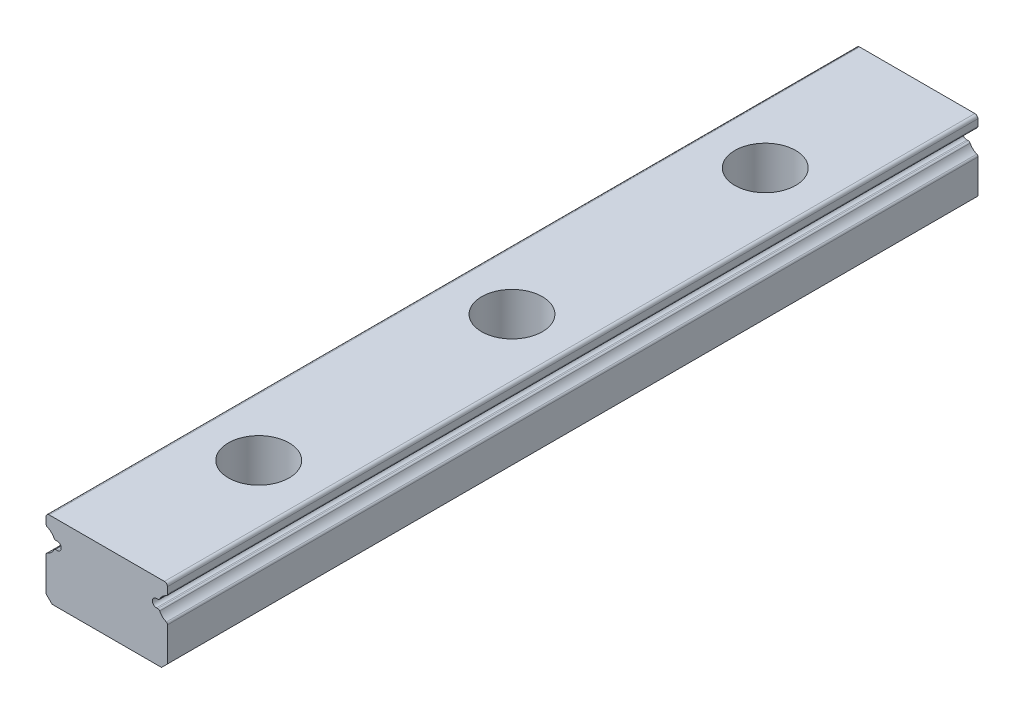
ISO-10303-21;
HEADER;
FILE_DESCRIPTION(('STEP AP214'),'2;1');
FILE_NAME('part.step','',(''),(''),'','','');
FILE_SCHEMA(('AUTOMOTIVE_DESIGN { 1 0 10303 214 1 1 1 1 }'));
ENDSEC;
DATA;
#1=APPLICATION_CONTEXT('core data for automotive mechanical design processes');
#2=APPLICATION_PROTOCOL_DEFINITION('international standard','automotive_design',2000,#1);
#3=PRODUCT_CONTEXT('',#1,'mechanical');
#4=PRODUCT('Part','Part','',(#3));
#5=PRODUCT_RELATED_PRODUCT_CATEGORY('part','',(#4));
#6=PRODUCT_DEFINITION_FORMATION('','',#4);
#7=PRODUCT_DEFINITION_CONTEXT('part definition',#1,'design');
#8=PRODUCT_DEFINITION('design','',#6,#7);
#9=PRODUCT_DEFINITION_SHAPE('','',#8);
#10=(LENGTH_UNIT() NAMED_UNIT(*) SI_UNIT(.MILLI.,.METRE.));
#11=(NAMED_UNIT(*) PLANE_ANGLE_UNIT() SI_UNIT($,.RADIAN.));
#12=(NAMED_UNIT(*) SI_UNIT($,.STERADIAN.) SOLID_ANGLE_UNIT());
#13=UNCERTAINTY_MEASURE_WITH_UNIT(LENGTH_MEASURE(1.E-05),#10,'distance_accuracy_value','');
#14=(GEOMETRIC_REPRESENTATION_CONTEXT(3) GLOBAL_UNCERTAINTY_ASSIGNED_CONTEXT((#13)) GLOBAL_UNIT_ASSIGNED_CONTEXT((#10,
#11,#12)) REPRESENTATION_CONTEXT('',''));
#15=CARTESIAN_POINT('',(0.,0.,0.));
#16=DIRECTION('',(0.,0.,1.));
#17=DIRECTION('',(1.,0.,0.));
#18=AXIS2_PLACEMENT_3D('',#15,#16,#17);
#19=CARTESIAN_POINT('',(-5.039393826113,-7.35,-80.));
#20=DIRECTION('',(0.,-1.,0.));
#21=DIRECTION('',(0.,0.,-1.));
#22=AXIS2_PLACEMENT_3D('',#19,#20,#21);
#23=PLANE('',#22);
#24=DIRECTION('',(1.,0.,0.));
#25=VECTOR('',#24,1.);
#26=CARTESIAN_POINT('',(-5.039393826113,-7.35,-80.));
#27=LINE('',#26,#25);
#28=CARTESIAN_POINT('',(-5.03939405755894,-7.35,-80.));
#29=VERTEX_POINT('',#28);
#30=CARTESIAN_POINT('',(-4.90000008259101,-7.35,-80.));
#31=VERTEX_POINT('',#30);
#32=EDGE_CURVE('E419',#29,#31,#27,.T.);
#33=ORIENTED_EDGE('',*,*,#32,.T.);
#34=DIRECTION('',(0.,0.,-1.));
#35=VECTOR('',#34,1.);
#36=CARTESIAN_POINT('',(-4.90000008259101,-7.35,-80.));
#37=LINE('',#36,#35);
#38=CARTESIAN_POINT('',(-4.90000008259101,-7.35,0.));
#39=VERTEX_POINT('',#38);
#40=EDGE_CURVE('E239',#31,#39,#37,.F.);
#41=ORIENTED_EDGE('',*,*,#40,.T.);
#42=DIRECTION('',(1.,0.,0.));
#43=VECTOR('',#42,1.);
#44=CARTESIAN_POINT('',(-5.039393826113,-7.35,0.));
#45=LINE('',#44,#43);
#46=CARTESIAN_POINT('',(-5.03939405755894,-7.35,0.));
#47=VERTEX_POINT('',#46);
#48=EDGE_CURVE('E423',#39,#47,#45,.F.);
#49=ORIENTED_EDGE('',*,*,#48,.T.);
#50=DIRECTION('',(0.,0.,-1.));
#51=VECTOR('',#50,1.);
#52=CARTESIAN_POINT('',(-5.039393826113,-7.35,-80.));
#53=LINE('',#52,#51);
#54=EDGE_CURVE('E242',#29,#47,#53,.F.);
#55=ORIENTED_EDGE('',*,*,#54,.F.);
#56=EDGE_LOOP('',(#33,#41,#49,#55));
#57=FACE_BOUND('',#56,.T.);
#58=ADVANCED_FACE('F16',(#57),#23,.T.);
#59=CARTESIAN_POINT('',(4.90000008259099,-7.35,-80.));
#60=DIRECTION('',(0.,-1.,0.));
#61=DIRECTION('',(0.,0.,-1.));
#62=AXIS2_PLACEMENT_3D('',#59,#60,#61);
#63=PLANE('',#62);
#64=DIRECTION('',(1.,0.,0.));
#65=VECTOR('',#64,1.);
#66=CARTESIAN_POINT('',(4.90000008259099,-7.35,-80.));
#67=LINE('',#66,#65);
#68=CARTESIAN_POINT('',(4.90000008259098,-7.35,-80.));
#69=VERTEX_POINT('',#68);
#70=CARTESIAN_POINT('',(5.04039419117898,-7.35,-80.));
#71=VERTEX_POINT('',#70);
#72=EDGE_CURVE('E209',#69,#71,#67,.T.);
#73=ORIENTED_EDGE('',*,*,#72,.T.);
#74=DIRECTION('',(0.,0.,-1.));
#75=VECTOR('',#74,1.);
#76=CARTESIAN_POINT('',(5.040394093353,-7.35,-80.));
#77=LINE('',#76,#75);
#78=CARTESIAN_POINT('',(5.04039419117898,-7.35,0.));
#79=VERTEX_POINT('',#78);
#80=EDGE_CURVE('E208',#79,#71,#77,.T.);
#81=ORIENTED_EDGE('',*,*,#80,.F.);
#82=DIRECTION('',(1.,0.,0.));
#83=VECTOR('',#82,1.);
#84=CARTESIAN_POINT('',(4.90000008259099,-7.35,0.));
#85=LINE('',#84,#83);
#86=CARTESIAN_POINT('',(4.90000008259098,-7.35,0.));
#87=VERTEX_POINT('',#86);
#88=EDGE_CURVE('E204',#79,#87,#85,.F.);
#89=ORIENTED_EDGE('',*,*,#88,.T.);
#90=DIRECTION('',(0.,0.,-1.));
#91=VECTOR('',#90,1.);
#92=CARTESIAN_POINT('',(4.90000008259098,-7.35,-80.));
#93=LINE('',#92,#91);
#94=EDGE_CURVE('E236',#87,#69,#93,.T.);
#95=ORIENTED_EDGE('',*,*,#94,.T.);
#96=EDGE_LOOP('',(#73,#81,#89,#95));
#97=FACE_BOUND('',#96,.T.);
#98=ADVANCED_FACE('F448',(#97),#63,.T.);
#99=CARTESIAN_POINT('',(5.04039428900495,-7.15000000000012,-80.));
#100=DIRECTION('',(0.,0.,-1.));
#101=DIRECTION('',(-1.,0.,0.));
#102=AXIS2_PLACEMENT_3D('',#99,#100,#101);
#103=CYLINDRICAL_SURFACE('',#102,0.2);
#104=CARTESIAN_POINT('',(5.04039428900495,-7.15000000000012,-80.));
#105=DIRECTION('',(0.,0.,-1.));
#106=DIRECTION('',(-1.,0.,0.));
#107=AXIS2_PLACEMENT_3D('',#104,#105,#106);
#108=CIRCLE('',#107,0.2);
#109=CARTESIAN_POINT('',(5.21899999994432,-7.24000000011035,-80.));
#110=VERTEX_POINT('',#109);
#111=EDGE_CURVE('E215',#71,#110,#108,.F.);
#112=ORIENTED_EDGE('',*,*,#111,.T.);
#113=DIRECTION('',(0.,0.,-1.));
#114=VECTOR('',#113,1.);
#115=CARTESIAN_POINT('',(5.21899999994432,-7.24000000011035,-80.));
#116=LINE('',#115,#114);
#117=CARTESIAN_POINT('',(5.21899999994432,-7.24000000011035,0.));
#118=VERTEX_POINT('',#117);
#119=EDGE_CURVE('E212',#110,#118,#116,.F.);
#120=ORIENTED_EDGE('',*,*,#119,.T.);
#121=CARTESIAN_POINT('',(5.04039428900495,-7.15000000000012,0.));
#122=DIRECTION('',(0.,0.,-1.));
#123=DIRECTION('',(-1.,0.,0.));
#124=AXIS2_PLACEMENT_3D('',#121,#122,#123);
#125=CIRCLE('',#124,0.2);
#126=EDGE_CURVE('E19',#118,#79,#125,.T.);
#127=ORIENTED_EDGE('',*,*,#126,.T.);
#128=ORIENTED_EDGE('',*,*,#80,.T.);
#129=EDGE_LOOP('',(#112,#120,#127,#128));
#130=FACE_BOUND('',#129,.T.);
#131=ADVANCED_FACE('F213',(#130),#103,.T.);
#132=CARTESIAN_POINT('',(-5.03939428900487,-7.15000000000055,-80.));
#133=DIRECTION('',(0.,0.,-1.));
#134=DIRECTION('',(-1.,0.,0.));
#135=AXIS2_PLACEMENT_3D('',#132,#133,#134);
#136=CYLINDRICAL_SURFACE('',#135,0.200000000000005);
#137=CARTESIAN_POINT('',(-5.03939428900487,-7.15000000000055,-80.));
#138=DIRECTION('',(0.,0.,-1.));
#139=DIRECTION('',(-1.,0.,0.));
#140=AXIS2_PLACEMENT_3D('',#137,#138,#139);
#141=CIRCLE('',#140,0.200000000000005);
#142=CARTESIAN_POINT('',(-5.21799999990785,-7.24000000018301,-80.));
#143=VERTEX_POINT('',#142);
#144=EDGE_CURVE('E243',#143,#29,#141,.F.);
#145=ORIENTED_EDGE('',*,*,#144,.T.);
#146=ORIENTED_EDGE('',*,*,#54,.T.);
#147=CARTESIAN_POINT('',(-5.03939428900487,-7.15000000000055,0.));
#148=DIRECTION('',(0.,0.,-1.));
#149=DIRECTION('',(-1.,0.,0.));
#150=AXIS2_PLACEMENT_3D('',#147,#148,#149);
#151=CIRCLE('',#150,0.200000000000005);
#152=CARTESIAN_POINT('',(-5.21799999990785,-7.24000000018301,0.));
#153=VERTEX_POINT('',#152);
#154=EDGE_CURVE('E246',#47,#153,#151,.T.);
#155=ORIENTED_EDGE('',*,*,#154,.T.);
#156=DIRECTION('',(0.,0.,-1.));
#157=VECTOR('',#156,1.);
#158=CARTESIAN_POINT('',(-5.21799999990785,-7.24000000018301,-80.));
#159=LINE('',#158,#157);
#160=EDGE_CURVE('E223',#153,#143,#159,.T.);
#161=ORIENTED_EDGE('',*,*,#160,.T.);
#162=EDGE_LOOP('',(#145,#146,#155,#161));
#163=FACE_BOUND('',#162,.T.);
#164=ADVANCED_FACE('F437',(#163),#136,.T.);
#165=CARTESIAN_POINT('',(-4.900000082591,-7.75,-80.));
#166=DIRECTION('',(0.,0.,-1.));
#167=DIRECTION('',(-1.,0.,0.));
#168=AXIS2_PLACEMENT_3D('',#165,#166,#167);
#169=CYLINDRICAL_SURFACE('',#168,0.399999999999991);
#170=ORIENTED_EDGE('',*,*,#40,.F.);
#171=CARTESIAN_POINT('',(-4.900000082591,-7.75,-80.));
#172=DIRECTION('',(0.,0.,-1.));
#173=DIRECTION('',(-1.,0.,0.));
#174=AXIS2_PLACEMENT_3D('',#171,#172,#173);
#175=CIRCLE('',#174,0.399999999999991);
#176=CARTESIAN_POINT('',(-4.900000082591,-8.15,-80.));
#177=VERTEX_POINT('',#176);
#178=EDGE_CURVE('E240',#177,#31,#175,.F.);
#179=ORIENTED_EDGE('',*,*,#178,.F.);
#180=DIRECTION('',(0.,0.,1.));
#181=VECTOR('',#180,1.);
#182=CARTESIAN_POINT('',(-4.900000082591,-8.15,-80.));
#183=LINE('',#182,#181);
#184=CARTESIAN_POINT('',(-4.900000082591,-8.15,0.));
#185=VERTEX_POINT('',#184);
#186=EDGE_CURVE('E357',#185,#177,#183,.F.);
#187=ORIENTED_EDGE('',*,*,#186,.F.);
#188=CARTESIAN_POINT('',(-4.900000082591,-7.75,0.));
#189=DIRECTION('',(0.,0.,-1.));
#190=DIRECTION('',(-1.,0.,0.));
#191=AXIS2_PLACEMENT_3D('',#188,#189,#190);
#192=CIRCLE('',#191,0.399999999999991);
#193=EDGE_CURVE('E237',#39,#185,#192,.T.);
#194=ORIENTED_EDGE('',*,*,#193,.F.);
#195=EDGE_LOOP('',(#170,#179,#187,#194));
#196=FACE_BOUND('',#195,.T.);
#197=ADVANCED_FACE('F432',(#196),#169,.F.);
#198=CARTESIAN_POINT('',(4.90000008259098,-7.75,-80.));
#199=DIRECTION('',(0.,0.,-1.));
#200=DIRECTION('',(-1.,0.,0.));
#201=AXIS2_PLACEMENT_3D('',#198,#199,#200);
#202=CYLINDRICAL_SURFACE('',#201,0.399999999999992);
#203=DIRECTION('',(0.,0.,1.));
#204=VECTOR('',#203,1.);
#205=CARTESIAN_POINT('',(4.90000008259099,-8.15,-80.));
#206=LINE('',#205,#204);
#207=CARTESIAN_POINT('',(4.90000008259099,-8.15,-80.));
#208=VERTEX_POINT('',#207);
#209=CARTESIAN_POINT('',(4.90000008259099,-8.15,0.));
#210=VERTEX_POINT('',#209);
#211=EDGE_CURVE('E350',#208,#210,#206,.T.);
#212=ORIENTED_EDGE('',*,*,#211,.F.);
#213=CARTESIAN_POINT('',(4.90000008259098,-7.75,-80.));
#214=DIRECTION('',(0.,0.,-1.));
#215=DIRECTION('',(-1.,0.,0.));
#216=AXIS2_PLACEMENT_3D('',#213,#214,#215);
#217=CIRCLE('',#216,0.399999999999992);
#218=EDGE_CURVE('E234',#69,#208,#217,.F.);
#219=ORIENTED_EDGE('',*,*,#218,.F.);
#220=ORIENTED_EDGE('',*,*,#94,.F.);
#221=CARTESIAN_POINT('',(4.90000008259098,-7.75,0.));
#222=DIRECTION('',(0.,0.,-1.));
#223=DIRECTION('',(-1.,0.,0.));
#224=AXIS2_PLACEMENT_3D('',#221,#222,#223);
#225=CIRCLE('',#224,0.399999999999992);
#226=EDGE_CURVE('E232',#210,#87,#225,.T.);
#227=ORIENTED_EDGE('',*,*,#226,.F.);
#228=EDGE_LOOP('',(#212,#219,#220,#227));
#229=FACE_BOUND('',#228,.T.);
#230=ADVANCED_FACE('F446',(#229),#202,.F.);
#231=CARTESIAN_POINT('',(6.36838540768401,-7.81680948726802,-80.));
#232=DIRECTION('',(0.,0.,-1.));
#233=DIRECTION('',(-1.,0.,0.));
#234=AXIS2_PLACEMENT_3D('',#231,#232,#233);
#235=CYLINDRICAL_SURFACE('',#234,1.286);
#236=ORIENTED_EDGE('',*,*,#119,.F.);
#237=CARTESIAN_POINT('',(6.36838540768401,-7.81680948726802,-80.));
#238=DIRECTION('',(0.,0.,-1.));
#239=DIRECTION('',(-1.,0.,0.));
#240=AXIS2_PLACEMENT_3D('',#237,#238,#239);
#241=CIRCLE('',#240,1.286);
#242=CARTESIAN_POINT('',(5.8660000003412,-6.63299999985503,-80.));
#243=VERTEX_POINT('',#242);
#244=EDGE_CURVE('E217',#243,#110,#241,.F.);
#245=ORIENTED_EDGE('',*,*,#244,.F.);
#246=DIRECTION('',(0.,0.,-1.));
#247=VECTOR('',#246,1.);
#248=CARTESIAN_POINT('',(5.8660000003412,-6.63299999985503,-80.));
#249=LINE('',#248,#247);
#250=CARTESIAN_POINT('',(5.8660000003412,-6.63299999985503,0.));
#251=VERTEX_POINT('',#250);
#252=EDGE_CURVE('E221',#251,#243,#249,.T.);
#253=ORIENTED_EDGE('',*,*,#252,.F.);
#254=CARTESIAN_POINT('',(6.36838540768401,-7.81680948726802,0.));
#255=DIRECTION('',(0.,0.,-1.));
#256=DIRECTION('',(-1.,0.,0.));
#257=AXIS2_PLACEMENT_3D('',#254,#255,#256);
#258=CIRCLE('',#257,1.286);
#259=EDGE_CURVE('E201',#118,#251,#258,.T.);
#260=ORIENTED_EDGE('',*,*,#259,.F.);
#261=EDGE_LOOP('',(#236,#245,#253,#260));
#262=FACE_BOUND('',#261,.T.);
#263=ADVANCED_FACE('F219',(#262),#235,.F.);
#264=CARTESIAN_POINT('',(-6.36738540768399,-7.81680948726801,-80.));
#265=DIRECTION('',(0.,0.,-1.));
#266=DIRECTION('',(-1.,0.,0.));
#267=AXIS2_PLACEMENT_3D('',#264,#265,#266);
#268=CYLINDRICAL_SURFACE('',#267,1.286);
#269=DIRECTION('',(0.,0.,-1.));
#270=VECTOR('',#269,1.);
#271=CARTESIAN_POINT('',(-5.86500000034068,-6.63299999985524,-80.));
#272=LINE('',#271,#270);
#273=CARTESIAN_POINT('',(-5.86500000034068,-6.63299999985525,-80.));
#274=VERTEX_POINT('',#273);
#275=CARTESIAN_POINT('',(-5.86500000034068,-6.63299999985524,0.));
#276=VERTEX_POINT('',#275);
#277=EDGE_CURVE('E340',#274,#276,#272,.F.);
#278=ORIENTED_EDGE('',*,*,#277,.F.);
#279=CARTESIAN_POINT('',(-6.36738540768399,-7.81680948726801,-80.));
#280=DIRECTION('',(0.,0.,-1.));
#281=DIRECTION('',(-1.,0.,0.));
#282=AXIS2_PLACEMENT_3D('',#279,#280,#281);
#283=CIRCLE('',#282,1.286);
#284=EDGE_CURVE('E226',#143,#274,#283,.F.);
#285=ORIENTED_EDGE('',*,*,#284,.F.);
#286=ORIENTED_EDGE('',*,*,#160,.F.);
#287=CARTESIAN_POINT('',(-6.36738540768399,-7.81680948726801,0.));
#288=DIRECTION('',(0.,0.,-1.));
#289=DIRECTION('',(-1.,0.,0.));
#290=AXIS2_PLACEMENT_3D('',#287,#288,#289);
#291=CIRCLE('',#290,1.286);
#292=EDGE_CURVE('E351',#276,#153,#291,.T.);
#293=ORIENTED_EDGE('',*,*,#292,.F.);
#294=EDGE_LOOP('',(#278,#285,#286,#293));
#295=FACE_BOUND('',#294,.T.);
#296=ADVANCED_FACE('F366',(#295),#268,.F.);
#297=CARTESIAN_POINT('',(-4.90000008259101,-8.15,-80.));
#298=DIRECTION('',(0.,1.,0.));
#299=DIRECTION('',(0.,0.,1.));
#300=AXIS2_PLACEMENT_3D('',#297,#298,#299);
#301=PLANE('',#300);
#302=DIRECTION('',(1.,0.,0.));
#303=VECTOR('',#302,1.);
#304=CARTESIAN_POINT('',(-4.90000008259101,-8.15,-80.));
#305=LINE('',#304,#303);
#306=CARTESIAN_POINT('',(-5.03939405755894,-8.15,-80.));
#307=VERTEX_POINT('',#306);
#308=EDGE_CURVE('E407',#177,#307,#305,.F.);
#309=ORIENTED_EDGE('',*,*,#308,.T.);
#310=DIRECTION('',(0.,0.,-1.));
#311=VECTOR('',#310,1.);
#312=CARTESIAN_POINT('',(-5.039393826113,-8.15,-80.));
#313=LINE('',#312,#311);
#314=CARTESIAN_POINT('',(-5.03939405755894,-8.15,0.));
#315=VERTEX_POINT('',#314);
#316=EDGE_CURVE('E336',#315,#307,#313,.T.);
#317=ORIENTED_EDGE('',*,*,#316,.F.);
#318=DIRECTION('',(1.,0.,0.));
#319=VECTOR('',#318,1.);
#320=CARTESIAN_POINT('',(-4.90000008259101,-8.15,0.));
#321=LINE('',#320,#319);
#322=EDGE_CURVE('E353',#315,#185,#321,.T.);
#323=ORIENTED_EDGE('',*,*,#322,.T.);
#324=ORIENTED_EDGE('',*,*,#186,.T.);
#325=EDGE_LOOP('',(#309,#317,#323,#324));
#326=FACE_BOUND('',#325,.T.);
#327=ADVANCED_FACE('F566',(#326),#301,.T.);
#328=CARTESIAN_POINT('',(5.040394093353,-8.15,-80.));
#329=DIRECTION('',(0.,1.,0.));
#330=DIRECTION('',(0.,0.,1.));
#331=AXIS2_PLACEMENT_3D('',#328,#329,#330);
#332=PLANE('',#331);
#333=DIRECTION('',(1.,0.,0.));
#334=VECTOR('',#333,1.);
#335=CARTESIAN_POINT('',(5.040394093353,-8.15,-80.));
#336=LINE('',#335,#334);
#337=CARTESIAN_POINT('',(5.04039419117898,-8.15,-80.));
#338=VERTEX_POINT('',#337);
#339=EDGE_CURVE('E401',#338,#208,#336,.F.);
#340=ORIENTED_EDGE('',*,*,#339,.T.);
#341=ORIENTED_EDGE('',*,*,#211,.T.);
#342=DIRECTION('',(1.,0.,0.));
#343=VECTOR('',#342,1.);
#344=CARTESIAN_POINT('',(5.040394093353,-8.15,0.));
#345=LINE('',#344,#343);
#346=CARTESIAN_POINT('',(5.04039419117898,-8.15,0.));
#347=VERTEX_POINT('',#346);
#348=EDGE_CURVE('E404',#210,#347,#345,.T.);
#349=ORIENTED_EDGE('',*,*,#348,.T.);
#350=DIRECTION('',(0.,0.,-1.));
#351=VECTOR('',#350,1.);
#352=CARTESIAN_POINT('',(5.040394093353,-8.15,-80.));
#353=LINE('',#352,#351);
#354=EDGE_CURVE('E330',#338,#347,#353,.F.);
#355=ORIENTED_EDGE('',*,*,#354,.F.);
#356=EDGE_LOOP('',(#340,#341,#349,#355));
#357=FACE_BOUND('',#356,.T.);
#358=ADVANCED_FACE('F562',(#357),#332,.T.);
#359=CARTESIAN_POINT('',(5.788,-6.44883702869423,-80.));
#360=DIRECTION('',(0.,0.,-1.));
#361=DIRECTION('',(-1.,0.,0.));
#362=AXIS2_PLACEMENT_3D('',#359,#360,#361);
#363=CYLINDRICAL_SURFACE('',#362,0.200000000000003);
#364=CARTESIAN_POINT('',(5.788,-6.44883702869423,-80.));
#365=DIRECTION('',(0.,0.,-1.));
#366=DIRECTION('',(-1.,0.,0.));
#367=AXIS2_PLACEMENT_3D('',#364,#365,#366);
#368=CIRCLE('',#367,0.200000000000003);
#369=CARTESIAN_POINT('',(5.988,-6.4488370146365,-80.));
#370=VERTEX_POINT('',#369);
#371=EDGE_CURVE('E347',#243,#370,#368,.F.);
#372=ORIENTED_EDGE('',*,*,#371,.T.);
#373=DIRECTION('',(0.,0.,-1.));
#374=VECTOR('',#373,1.);
#375=CARTESIAN_POINT('',(5.988,-6.44883700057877,-80.));
#376=LINE('',#375,#374);
#377=CARTESIAN_POINT('',(5.988,-6.4488370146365,0.));
#378=VERTEX_POINT('',#377);
#379=EDGE_CURVE('E389',#378,#370,#376,.T.);
#380=ORIENTED_EDGE('',*,*,#379,.F.);
#381=CARTESIAN_POINT('',(5.788,-6.44883702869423,0.));
#382=DIRECTION('',(0.,0.,-1.));
#383=DIRECTION('',(-1.,0.,0.));
#384=AXIS2_PLACEMENT_3D('',#381,#382,#383);
#385=CIRCLE('',#384,0.200000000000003);
#386=EDGE_CURVE('E349',#378,#251,#385,.T.);
#387=ORIENTED_EDGE('',*,*,#386,.T.);
#388=ORIENTED_EDGE('',*,*,#252,.T.);
#389=EDGE_LOOP('',(#372,#380,#387,#388));
#390=FACE_BOUND('',#389,.T.);
#391=ADVANCED_FACE('F559',(#390),#363,.T.);
#392=CARTESIAN_POINT('',(-5.787,-6.44883702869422,-80.));
#393=DIRECTION('',(0.,0.,-1.));
#394=DIRECTION('',(-1.,0.,0.));
#395=AXIS2_PLACEMENT_3D('',#392,#393,#394);
#396=CYLINDRICAL_SURFACE('',#395,0.2);
#397=CARTESIAN_POINT('',(-5.787,-6.44883702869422,-80.));
#398=DIRECTION('',(0.,0.,-1.));
#399=DIRECTION('',(-1.,0.,0.));
#400=AXIS2_PLACEMENT_3D('',#397,#398,#399);
#401=CIRCLE('',#400,0.2);
#402=CARTESIAN_POINT('',(-5.987,-6.44883701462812,-80.));
#403=VERTEX_POINT('',#402);
#404=EDGE_CURVE('E341',#403,#274,#401,.F.);
#405=ORIENTED_EDGE('',*,*,#404,.T.);
#406=ORIENTED_EDGE('',*,*,#277,.T.);
#407=CARTESIAN_POINT('',(-5.787,-6.44883702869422,0.));
#408=DIRECTION('',(0.,0.,-1.));
#409=DIRECTION('',(-1.,0.,0.));
#410=AXIS2_PLACEMENT_3D('',#407,#408,#409);
#411=CIRCLE('',#410,0.2);
#412=CARTESIAN_POINT('',(-5.987,-6.44883701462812,0.));
#413=VERTEX_POINT('',#412);
#414=EDGE_CURVE('E344',#276,#413,#411,.T.);
#415=ORIENTED_EDGE('',*,*,#414,.T.);
#416=DIRECTION('',(0.,0.,1.));
#417=VECTOR('',#416,1.);
#418=CARTESIAN_POINT('',(-5.987,-6.44883700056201,-80.));
#419=LINE('',#418,#417);
#420=EDGE_CURVE('E326',#403,#413,#419,.T.);
#421=ORIENTED_EDGE('',*,*,#420,.F.);
#422=EDGE_LOOP('',(#405,#406,#415,#421));
#423=FACE_BOUND('',#422,.T.);
#424=ADVANCED_FACE('F369',(#423),#396,.T.);
#425=CARTESIAN_POINT('',(-5.03939428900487,-8.34999999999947,-80.));
#426=DIRECTION('',(0.,0.,-1.));
#427=DIRECTION('',(-1.,0.,0.));
#428=AXIS2_PLACEMENT_3D('',#425,#426,#427);
#429=CYLINDRICAL_SURFACE('',#428,0.200000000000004);
#430=CARTESIAN_POINT('',(-5.03939428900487,-8.34999999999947,-80.));
#431=DIRECTION('',(0.,0.,-1.));
#432=DIRECTION('',(-1.,0.,0.));
#433=AXIS2_PLACEMENT_3D('',#430,#431,#432);
#434=CIRCLE('',#433,0.200000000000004);
#435=CARTESIAN_POINT('',(-5.21800000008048,-8.26000000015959,-80.));
#436=VERTEX_POINT('',#435);
#437=EDGE_CURVE('E333',#307,#436,#434,.F.);
#438=ORIENTED_EDGE('',*,*,#437,.T.);
#439=DIRECTION('',(0.,0.,-1.));
#440=VECTOR('',#439,1.);
#441=CARTESIAN_POINT('',(-5.21800000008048,-8.26000000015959,-80.));
#442=LINE('',#441,#440);
#443=CARTESIAN_POINT('',(-5.21800000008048,-8.26000000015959,0.));
#444=VERTEX_POINT('',#443);
#445=EDGE_CURVE('E323',#436,#444,#442,.F.);
#446=ORIENTED_EDGE('',*,*,#445,.T.);
#447=CARTESIAN_POINT('',(-5.03939428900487,-8.34999999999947,0.));
#448=DIRECTION('',(0.,0.,-1.));
#449=DIRECTION('',(-1.,0.,0.));
#450=AXIS2_PLACEMENT_3D('',#447,#448,#449);
#451=CIRCLE('',#450,0.200000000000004);
#452=EDGE_CURVE('E337',#444,#315,#451,.T.);
#453=ORIENTED_EDGE('',*,*,#452,.T.);
#454=ORIENTED_EDGE('',*,*,#316,.T.);
#455=EDGE_LOOP('',(#438,#446,#453,#454));
#456=FACE_BOUND('',#455,.T.);
#457=ADVANCED_FACE('F552',(#456),#429,.T.);
#458=CARTESIAN_POINT('',(5.04039428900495,-8.34999999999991,-80.));
#459=DIRECTION('',(0.,0.,-1.));
#460=DIRECTION('',(-1.,0.,0.));
#461=AXIS2_PLACEMENT_3D('',#458,#459,#460);
#462=CYLINDRICAL_SURFACE('',#461,0.200000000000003);
#463=CARTESIAN_POINT('',(5.04039428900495,-8.34999999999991,-80.));
#464=DIRECTION('',(0.,0.,-1.));
#465=DIRECTION('',(-1.,0.,0.));
#466=AXIS2_PLACEMENT_3D('',#463,#464,#465);
#467=CIRCLE('',#466,0.200000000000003);
#468=CARTESIAN_POINT('',(5.21900000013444,-8.26000000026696,-80.));
#469=VERTEX_POINT('',#468);
#470=EDGE_CURVE('E327',#469,#338,#467,.F.);
#471=ORIENTED_EDGE('',*,*,#470,.T.);
#472=ORIENTED_EDGE('',*,*,#354,.T.);
#473=CARTESIAN_POINT('',(5.04039428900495,-8.34999999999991,0.));
#474=DIRECTION('',(0.,0.,-1.));
#475=DIRECTION('',(-1.,0.,0.));
#476=AXIS2_PLACEMENT_3D('',#473,#474,#475);
#477=CIRCLE('',#476,0.200000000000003);
#478=CARTESIAN_POINT('',(5.21900000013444,-8.26000000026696,0.));
#479=VERTEX_POINT('',#478);
#480=EDGE_CURVE('E331',#347,#479,#477,.T.);
#481=ORIENTED_EDGE('',*,*,#480,.T.);
#482=DIRECTION('',(0.,0.,-1.));
#483=VECTOR('',#482,1.);
#484=CARTESIAN_POINT('',(5.21900000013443,-8.26000000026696,-80.));
#485=LINE('',#484,#483);
#486=EDGE_CURVE('E320',#479,#469,#485,.T.);
#487=ORIENTED_EDGE('',*,*,#486,.T.);
#488=EDGE_LOOP('',(#471,#472,#481,#487));
#489=FACE_BOUND('',#488,.T.);
#490=ADVANCED_FACE('F548',(#489),#462,.T.);
#491=CARTESIAN_POINT('',(5.988,-6.44883700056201,-80.));
#492=DIRECTION('',(1.,0.,0.));
#493=DIRECTION('',(0.,0.,-1.));
#494=AXIS2_PLACEMENT_3D('',#491,#492,#493);
#495=PLANE('',#494);
#496=DIRECTION('',(0.,1.,0.));
#497=VECTOR('',#496,1.);
#498=CARTESIAN_POINT('',(5.988,-6.44883700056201,-80.));
#499=LINE('',#498,#497);
#500=CARTESIAN_POINT('',(5.988,-5.8,-80.));
#501=VERTEX_POINT('',#500);
#502=EDGE_CURVE('E381',#370,#501,#499,.T.);
#503=ORIENTED_EDGE('',*,*,#502,.T.);
#504=DIRECTION('',(0.,0.,-1.));
#505=VECTOR('',#504,1.);
#506=CARTESIAN_POINT('',(5.988,-5.8,-80.));
#507=LINE('',#506,#505);
#508=CARTESIAN_POINT('',(5.988,-5.8,0.));
#509=VERTEX_POINT('',#508);
#510=EDGE_CURVE('E311',#509,#501,#507,.T.);
#511=ORIENTED_EDGE('',*,*,#510,.F.);
#512=DIRECTION('',(0.,1.,0.));
#513=VECTOR('',#512,1.);
#514=CARTESIAN_POINT('',(5.988,-6.44883700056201,0.));
#515=LINE('',#514,#513);
#516=EDGE_CURVE('E390',#509,#378,#515,.F.);
#517=ORIENTED_EDGE('',*,*,#516,.T.);
#518=ORIENTED_EDGE('',*,*,#379,.T.);
#519=EDGE_LOOP('',(#503,#511,#517,#518));
#520=FACE_BOUND('',#519,.T.);
#521=ADVANCED_FACE('F545',(#520),#495,.T.);
#522=CARTESIAN_POINT('',(-5.987,-5.8,-80.));
#523=DIRECTION('',(-1.,0.,0.));
#524=DIRECTION('',(0.,0.,1.));
#525=AXIS2_PLACEMENT_3D('',#522,#523,#524);
#526=PLANE('',#525);
#527=DIRECTION('',(0.,1.,0.));
#528=VECTOR('',#527,1.);
#529=CARTESIAN_POINT('',(-5.987,-5.8,-80.));
#530=LINE('',#529,#528);
#531=CARTESIAN_POINT('',(-5.987,-5.8,-80.));
#532=VERTEX_POINT('',#531);
#533=EDGE_CURVE('E374',#532,#403,#530,.F.);
#534=ORIENTED_EDGE('',*,*,#533,.T.);
#535=ORIENTED_EDGE('',*,*,#420,.T.);
#536=DIRECTION('',(0.,1.,0.));
#537=VECTOR('',#536,1.);
#538=CARTESIAN_POINT('',(-5.987,-5.8,0.));
#539=LINE('',#538,#537);
#540=CARTESIAN_POINT('',(-5.987,-5.8,0.));
#541=VERTEX_POINT('',#540);
#542=EDGE_CURVE('E379',#413,#541,#539,.T.);
#543=ORIENTED_EDGE('',*,*,#542,.T.);
#544=DIRECTION('',(0.,0.,-1.));
#545=VECTOR('',#544,1.);
#546=CARTESIAN_POINT('',(-5.987,-5.8,-80.));
#547=LINE('',#546,#545);
#548=EDGE_CURVE('E303',#532,#541,#547,.F.);
#549=ORIENTED_EDGE('',*,*,#548,.F.);
#550=EDGE_LOOP('',(#534,#535,#543,#549));
#551=FACE_BOUND('',#550,.T.);
#552=ADVANCED_FACE('F377',(#551),#526,.T.);
#553=CARTESIAN_POINT('',(-6.36699997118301,-7.68242310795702,-80.));
#554=DIRECTION('',(0.,0.,-1.));
#555=DIRECTION('',(-1.,0.,0.));
#556=AXIS2_PLACEMENT_3D('',#553,#554,#555);
#557=CYLINDRICAL_SURFACE('',#556,1.286);
#558=ORIENTED_EDGE('',*,*,#445,.F.);
#559=CARTESIAN_POINT('',(-6.36699997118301,-7.68242310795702,-80.));
#560=DIRECTION('',(0.,0.,-1.));
#561=DIRECTION('',(-1.,0.,0.));
#562=AXIS2_PLACEMENT_3D('',#559,#560,#561);
#563=CIRCLE('',#562,1.286);
#564=CARTESIAN_POINT('',(-5.87600000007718,-8.87100000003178,-80.));
#565=VERTEX_POINT('',#564);
#566=EDGE_CURVE('E324',#565,#436,#563,.F.);
#567=ORIENTED_EDGE('',*,*,#566,.F.);
#568=DIRECTION('',(0.,0.,-1.));
#569=VECTOR('',#568,1.);
#570=CARTESIAN_POINT('',(-5.87600000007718,-8.87100000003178,-80.));
#571=LINE('',#570,#569);
#572=CARTESIAN_POINT('',(-5.87600000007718,-8.87100000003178,0.));
#573=VERTEX_POINT('',#572);
#574=EDGE_CURVE('E299',#573,#565,#571,.T.);
#575=ORIENTED_EDGE('',*,*,#574,.F.);
#576=CARTESIAN_POINT('',(-6.36699997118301,-7.68242310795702,0.));
#577=DIRECTION('',(0.,0.,-1.));
#578=DIRECTION('',(-1.,0.,0.));
#579=AXIS2_PLACEMENT_3D('',#576,#577,#578);
#580=CIRCLE('',#579,1.286);
#581=EDGE_CURVE('E321',#444,#573,#580,.T.);
#582=ORIENTED_EDGE('',*,*,#581,.F.);
#583=EDGE_LOOP('',(#558,#567,#575,#582));
#584=FACE_BOUND('',#583,.T.);
#585=ADVANCED_FACE('F538',(#584),#557,.F.);
#586=CARTESIAN_POINT('',(6.36799997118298,-7.68242310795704,-80.));
#587=DIRECTION('',(0.,0.,-1.));
#588=DIRECTION('',(-1.,0.,0.));
#589=AXIS2_PLACEMENT_3D('',#586,#587,#588);
#590=CYLINDRICAL_SURFACE('',#589,1.28599999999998);
#591=DIRECTION('',(0.,0.,-1.));
#592=VECTOR('',#591,1.);
#593=CARTESIAN_POINT('',(5.87700000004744,-8.8710000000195,-80.));
#594=LINE('',#593,#592);
#595=CARTESIAN_POINT('',(5.87700000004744,-8.8710000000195,-80.));
#596=VERTEX_POINT('',#595);
#597=CARTESIAN_POINT('',(5.87700000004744,-8.8710000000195,0.));
#598=VERTEX_POINT('',#597);
#599=EDGE_CURVE('E291',#596,#598,#594,.F.);
#600=ORIENTED_EDGE('',*,*,#599,.F.);
#601=CARTESIAN_POINT('',(6.36799997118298,-7.68242310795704,-80.));
#602=DIRECTION('',(0.,0.,-1.));
#603=DIRECTION('',(-1.,0.,0.));
#604=AXIS2_PLACEMENT_3D('',#601,#602,#603);
#605=CIRCLE('',#604,1.28599999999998);
#606=EDGE_CURVE('E318',#469,#596,#605,.F.);
#607=ORIENTED_EDGE('',*,*,#606,.F.);
#608=ORIENTED_EDGE('',*,*,#486,.F.);
#609=CARTESIAN_POINT('',(6.36799997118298,-7.68242310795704,0.));
#610=DIRECTION('',(0.,0.,-1.));
#611=DIRECTION('',(-1.,0.,0.));
#612=AXIS2_PLACEMENT_3D('',#609,#610,#611);
#613=CIRCLE('',#612,1.28599999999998);
#614=EDGE_CURVE('E315',#598,#479,#613,.T.);
#615=ORIENTED_EDGE('',*,*,#614,.F.);
#616=EDGE_LOOP('',(#600,#607,#608,#615));
#617=FACE_BOUND('',#616,.T.);
#618=ADVANCED_FACE('F534',(#617),#590,.F.);
#619=CARTESIAN_POINT('',(0.,-13.,-40.));
#620=DIRECTION('',(0.,1.,0.));
#621=DIRECTION('',(0.,0.,1.));
#622=AXIS2_PLACEMENT_3D('',#619,#620,#621);
#623=CYLINDRICAL_SURFACE('',#622,3.);
#624=CARTESIAN_POINT('',(0.,-5.5,-40.));
#625=DIRECTION('',(0.,1.,0.));
#626=DIRECTION('',(0.,0.,1.));
#627=AXIS2_PLACEMENT_3D('',#624,#625,#626);
#628=CIRCLE('',#627,3.);
#629=CARTESIAN_POINT('',(0.,-5.5,-37.));
#630=VERTEX_POINT('',#629);
#631=EDGE_CURVE('E284',#630,#630,#628,.F.);
#632=ORIENTED_EDGE('',*,*,#631,.F.);
#633=EDGE_LOOP('',(#632));
#634=FACE_BOUND('',#633,.T.);
#635=CARTESIAN_POINT('',(0.,-10.,-40.));
#636=DIRECTION('',(0.,1.,0.));
#637=DIRECTION('',(0.,0.,1.));
#638=AXIS2_PLACEMENT_3D('',#635,#636,#637);
#639=CIRCLE('',#638,3.);
#640=CARTESIAN_POINT('',(0.,-10.,-37.));
#641=VERTEX_POINT('',#640);
#642=EDGE_CURVE('E288',#641,#641,#639,.T.);
#643=ORIENTED_EDGE('',*,*,#642,.F.);
#644=EDGE_LOOP('',(#643));
#645=FACE_BOUND('',#644,.T.);
#646=ADVANCED_FACE('F530',(#634,#645),#623,.F.);
#647=CARTESIAN_POINT('',(5.688,-5.8,-80.));
#648=DIRECTION('',(0.,0.,-1.));
#649=DIRECTION('',(-1.,0.,0.));
#650=AXIS2_PLACEMENT_3D('',#647,#648,#649);
#651=CYLINDRICAL_SURFACE('',#650,0.3);
#652=CARTESIAN_POINT('',(5.688,-5.8,-80.));
#653=DIRECTION('',(0.,0.,-1.));
#654=DIRECTION('',(-1.,0.,0.));
#655=AXIS2_PLACEMENT_3D('',#652,#653,#654);
#656=CIRCLE('',#655,0.3);
#657=CARTESIAN_POINT('',(5.688,-5.5,-80.));
#658=VERTEX_POINT('',#657);
#659=EDGE_CURVE('E309',#501,#658,#656,.F.);
#660=ORIENTED_EDGE('',*,*,#659,.T.);
#661=DIRECTION('',(0.,0.,1.));
#662=VECTOR('',#661,1.);
#663=CARTESIAN_POINT('',(5.688,-5.5,-80.));
#664=LINE('',#663,#662);
#665=CARTESIAN_POINT('',(5.688,-5.5,0.));
#666=VERTEX_POINT('',#665);
#667=EDGE_CURVE('E287',#666,#658,#664,.F.);
#668=ORIENTED_EDGE('',*,*,#667,.F.);
#669=CARTESIAN_POINT('',(5.688,-5.8,0.));
#670=DIRECTION('',(0.,0.,-1.));
#671=DIRECTION('',(-1.,0.,0.));
#672=AXIS2_PLACEMENT_3D('',#669,#670,#671);
#673=CIRCLE('',#672,0.3);
#674=EDGE_CURVE('E312',#666,#509,#673,.T.);
#675=ORIENTED_EDGE('',*,*,#674,.T.);
#676=ORIENTED_EDGE('',*,*,#510,.T.);
#677=EDGE_LOOP('',(#660,#668,#675,#676));
#678=FACE_BOUND('',#677,.T.);
#679=ADVANCED_FACE('F526',(#678),#651,.T.);
#680=CARTESIAN_POINT('',(-5.687,-5.8,-80.));
#681=DIRECTION('',(0.,0.,-1.));
#682=DIRECTION('',(-1.,0.,0.));
#683=AXIS2_PLACEMENT_3D('',#680,#681,#682);
#684=CYLINDRICAL_SURFACE('',#683,0.3);
#685=CARTESIAN_POINT('',(-5.687,-5.8,-80.));
#686=DIRECTION('',(0.,0.,-1.));
#687=DIRECTION('',(-1.,0.,0.));
#688=AXIS2_PLACEMENT_3D('',#685,#686,#687);
#689=CIRCLE('',#688,0.3);
#690=CARTESIAN_POINT('',(-5.687,-5.5,-80.));
#691=VERTEX_POINT('',#690);
#692=EDGE_CURVE('E304',#691,#532,#689,.F.);
#693=ORIENTED_EDGE('',*,*,#692,.T.);
#694=ORIENTED_EDGE('',*,*,#548,.T.);
#695=CARTESIAN_POINT('',(-5.687,-5.8,0.));
#696=DIRECTION('',(0.,0.,-1.));
#697=DIRECTION('',(-1.,0.,0.));
#698=AXIS2_PLACEMENT_3D('',#695,#696,#697);
#699=CIRCLE('',#698,0.3);
#700=CARTESIAN_POINT('',(-5.687,-5.5,0.));
#701=VERTEX_POINT('',#700);
#702=EDGE_CURVE('E307',#541,#701,#699,.T.);
#703=ORIENTED_EDGE('',*,*,#702,.T.);
#704=DIRECTION('',(0.,0.,1.));
#705=VECTOR('',#704,1.);
#706=CARTESIAN_POINT('',(-5.687,-5.5,-80.));
#707=LINE('',#706,#705);
#708=EDGE_CURVE('E283',#691,#701,#707,.T.);
#709=ORIENTED_EDGE('',*,*,#708,.F.);
#710=EDGE_LOOP('',(#693,#694,#703,#709));
#711=FACE_BOUND('',#710,.T.);
#712=ADVANCED_FACE('F522',(#711),#684,.T.);
#713=CARTESIAN_POINT('',(-5.8,-9.05599729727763,-80.));
#714=DIRECTION('',(0.,0.,-1.));
#715=DIRECTION('',(-1.,0.,0.));
#716=AXIS2_PLACEMENT_3D('',#713,#714,#715);
#717=CYLINDRICAL_SURFACE('',#716,0.200000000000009);
#718=CARTESIAN_POINT('',(-5.8,-9.05599729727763,-80.));
#719=DIRECTION('',(0.,0.,-1.));
#720=DIRECTION('',(-1.,0.,0.));
#721=AXIS2_PLACEMENT_3D('',#718,#719,#720);
#722=CIRCLE('',#721,0.200000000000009);
#723=CARTESIAN_POINT('',(-6.,-9.05599729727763,-80.));
#724=VERTEX_POINT('',#723);
#725=EDGE_CURVE('E297',#565,#724,#722,.F.);
#726=ORIENTED_EDGE('',*,*,#725,.T.);
#727=DIRECTION('',(0.,0.,1.));
#728=VECTOR('',#727,1.);
#729=CARTESIAN_POINT('',(-6.,-9.05599729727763,-80.));
#730=LINE('',#729,#728);
#731=CARTESIAN_POINT('',(-6.,-9.05599729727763,0.));
#732=VERTEX_POINT('',#731);
#733=EDGE_CURVE('E279',#732,#724,#730,.F.);
#734=ORIENTED_EDGE('',*,*,#733,.F.);
#735=CARTESIAN_POINT('',(-5.8,-9.05599729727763,0.));
#736=DIRECTION('',(0.,0.,-1.));
#737=DIRECTION('',(-1.,0.,0.));
#738=AXIS2_PLACEMENT_3D('',#735,#736,#737);
#739=CIRCLE('',#738,0.200000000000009);
#740=EDGE_CURVE('E300',#732,#573,#739,.T.);
#741=ORIENTED_EDGE('',*,*,#740,.T.);
#742=ORIENTED_EDGE('',*,*,#574,.T.);
#743=EDGE_LOOP('',(#726,#734,#741,#742));
#744=FACE_BOUND('',#743,.T.);
#745=ADVANCED_FACE('F518',(#744),#717,.T.);
#746=CARTESIAN_POINT('',(5.80000000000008,-9.05558331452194,-80.));
#747=DIRECTION('',(0.,0.,-1.));
#748=DIRECTION('',(-1.,0.,0.));
#749=AXIS2_PLACEMENT_3D('',#746,#747,#748);
#750=CYLINDRICAL_SURFACE('',#749,0.200000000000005);
#751=CARTESIAN_POINT('',(5.80000000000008,-9.05558331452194,-80.));
#752=DIRECTION('',(0.,0.,-1.));
#753=DIRECTION('',(-1.,0.,0.));
#754=AXIS2_PLACEMENT_3D('',#751,#752,#753);
#755=CIRCLE('',#754,0.200000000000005);
#756=CARTESIAN_POINT('',(6.,-9.05558340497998,-80.));
#757=VERTEX_POINT('',#756);
#758=EDGE_CURVE('E292',#757,#596,#755,.F.);
#759=ORIENTED_EDGE('',*,*,#758,.T.);
#760=ORIENTED_EDGE('',*,*,#599,.T.);
#761=CARTESIAN_POINT('',(5.80000000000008,-9.05558331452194,0.));
#762=DIRECTION('',(0.,0.,-1.));
#763=DIRECTION('',(-1.,0.,0.));
#764=AXIS2_PLACEMENT_3D('',#761,#762,#763);
#765=CIRCLE('',#764,0.200000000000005);
#766=CARTESIAN_POINT('',(6.,-9.05558340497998,0.));
#767=VERTEX_POINT('',#766);
#768=EDGE_CURVE('E295',#598,#767,#765,.T.);
#769=ORIENTED_EDGE('',*,*,#768,.T.);
#770=DIRECTION('',(0.,0.,-1.));
#771=VECTOR('',#770,1.);
#772=CARTESIAN_POINT('',(6.,-9.05558349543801,-80.));
#773=LINE('',#772,#771);
#774=EDGE_CURVE('E275',#757,#767,#773,.F.);
#775=ORIENTED_EDGE('',*,*,#774,.F.);
#776=EDGE_LOOP('',(#759,#760,#769,#775));
#777=FACE_BOUND('',#776,.T.);
#778=ADVANCED_FACE('F514',(#777),#750,.T.);
#779=CARTESIAN_POINT('',(0.,-13.,-15.));
#780=DIRECTION('',(0.,1.,0.));
#781=DIRECTION('',(0.,0.,1.));
#782=AXIS2_PLACEMENT_3D('',#779,#780,#781);
#783=CYLINDRICAL_SURFACE('',#782,3.);
#784=CARTESIAN_POINT('',(0.,-5.5,-15.));
#785=DIRECTION('',(0.,1.,0.));
#786=DIRECTION('',(0.,0.,1.));
#787=AXIS2_PLACEMENT_3D('',#784,#785,#786);
#788=CIRCLE('',#787,3.);
#789=CARTESIAN_POINT('',(0.,-5.5,-12.));
#790=VERTEX_POINT('',#789);
#791=EDGE_CURVE('E280',#790,#790,#788,.F.);
#792=ORIENTED_EDGE('',*,*,#791,.F.);
#793=EDGE_LOOP('',(#792));
#794=FACE_BOUND('',#793,.T.);
#795=CARTESIAN_POINT('',(0.,-10.,-15.));
#796=DIRECTION('',(0.,1.,0.));
#797=DIRECTION('',(0.,0.,1.));
#798=AXIS2_PLACEMENT_3D('',#795,#796,#797);
#799=CIRCLE('',#798,3.);
#800=CARTESIAN_POINT('',(0.,-10.,-12.));
#801=VERTEX_POINT('',#800);
#802=EDGE_CURVE('E272',#801,#801,#799,.T.);
#803=ORIENTED_EDGE('',*,*,#802,.F.);
#804=EDGE_LOOP('',(#803));
#805=FACE_BOUND('',#804,.T.);
#806=ADVANCED_FACE('F510',(#794,#805),#783,.F.);
#807=CARTESIAN_POINT('',(0.,-13.,-65.));
#808=DIRECTION('',(0.,1.,0.));
#809=DIRECTION('',(0.,0.,1.));
#810=AXIS2_PLACEMENT_3D('',#807,#808,#809);
#811=CYLINDRICAL_SURFACE('',#810,3.);
#812=CARTESIAN_POINT('',(0.,-5.5,-65.));
#813=DIRECTION('',(0.,1.,0.));
#814=DIRECTION('',(0.,0.,1.));
#815=AXIS2_PLACEMENT_3D('',#812,#813,#814);
#816=CIRCLE('',#815,3.);
#817=CARTESIAN_POINT('',(0.,-5.5,-62.));
#818=VERTEX_POINT('',#817);
#819=EDGE_CURVE('E276',#818,#818,#816,.F.);
#820=ORIENTED_EDGE('',*,*,#819,.F.);
#821=EDGE_LOOP('',(#820));
#822=FACE_BOUND('',#821,.T.);
#823=CARTESIAN_POINT('',(0.,-10.,-65.));
#824=DIRECTION('',(0.,1.,0.));
#825=DIRECTION('',(0.,0.,1.));
#826=AXIS2_PLACEMENT_3D('',#823,#824,#825);
#827=CIRCLE('',#826,3.);
#828=CARTESIAN_POINT('',(0.,-10.,-62.));
#829=VERTEX_POINT('',#828);
#830=EDGE_CURVE('E269',#829,#829,#827,.T.);
#831=ORIENTED_EDGE('',*,*,#830,.F.);
#832=EDGE_LOOP('',(#831));
#833=FACE_BOUND('',#832,.T.);
#834=ADVANCED_FACE('F506',(#822,#833),#811,.F.);
#835=CARTESIAN_POINT('',(0.,-10.,-43.));
#836=DIRECTION('',(0.,1.,0.));
#837=DIRECTION('',(0.,0.,1.));
#838=AXIS2_PLACEMENT_3D('',#835,#836,#837);
#839=PLANE('',#838);
#840=ORIENTED_EDGE('',*,*,#642,.T.);
#841=EDGE_LOOP('',(#840));
#842=FACE_BOUND('',#841,.T.);
#843=CARTESIAN_POINT('',(0.,-10.,-40.));
#844=DIRECTION('',(0.,1.,0.));
#845=DIRECTION('',(0.,0.,1.));
#846=AXIS2_PLACEMENT_3D('',#843,#844,#845);
#847=CIRCLE('',#846,1.75);
#848=CARTESIAN_POINT('',(0.,-10.,-38.25));
#849=VERTEX_POINT('',#848);
#850=EDGE_CURVE('E265',#849,#849,#847,.F.);
#851=ORIENTED_EDGE('',*,*,#850,.T.);
#852=EDGE_LOOP('',(#851));
#853=FACE_BOUND('',#852,.T.);
#854=ADVANCED_FACE('F502',(#842,#853),#839,.T.);
#855=CARTESIAN_POINT('',(5.688,-5.5,-80.));
#856=DIRECTION('',(0.,1.,0.));
#857=DIRECTION('',(0.,0.,1.));
#858=AXIS2_PLACEMENT_3D('',#855,#856,#857);
#859=PLANE('',#858);
#860=ORIENTED_EDGE('',*,*,#819,.T.);
#861=EDGE_LOOP('',(#860));
#862=FACE_BOUND('',#861,.T.);
#863=ORIENTED_EDGE('',*,*,#791,.T.);
#864=EDGE_LOOP('',(#863));
#865=FACE_BOUND('',#864,.T.);
#866=DIRECTION('',(1.,0.,0.));
#867=VECTOR('',#866,1.);
#868=CARTESIAN_POINT('',(5.80000000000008,-5.5,-80.));
#869=LINE('',#868,#867);
#870=EDGE_CURVE('E599',#658,#691,#869,.F.);
#871=ORIENTED_EDGE('',*,*,#870,.T.);
#872=ORIENTED_EDGE('',*,*,#708,.T.);
#873=DIRECTION('',(1.,0.,0.));
#874=VECTOR('',#873,1.);
#875=CARTESIAN_POINT('',(5.80000000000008,-5.5,0.));
#876=LINE('',#875,#874);
#877=EDGE_CURVE('E611',#666,#701,#876,.F.);
#878=ORIENTED_EDGE('',*,*,#877,.F.);
#879=ORIENTED_EDGE('',*,*,#667,.T.);
#880=EDGE_LOOP('',(#871,#872,#878,#879));
#881=FACE_BOUND('',#880,.T.);
#882=ORIENTED_EDGE('',*,*,#631,.T.);
#883=EDGE_LOOP('',(#882));
#884=FACE_BOUND('',#883,.T.);
#885=ADVANCED_FACE('F498',(#862,#865,#881,#884),#859,.T.);
#886=CARTESIAN_POINT('',(-6.,-9.05599729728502,-80.));
#887=DIRECTION('',(-1.,0.,0.));
#888=DIRECTION('',(0.,0.,1.));
#889=AXIS2_PLACEMENT_3D('',#886,#887,#888);
#890=PLANE('',#889);
#891=DIRECTION('',(0.,1.,0.));
#892=VECTOR('',#891,1.);
#893=CARTESIAN_POINT('',(-6.,-9.05558331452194,-80.));
#894=LINE('',#893,#892);
#895=CARTESIAN_POINT('',(-6.,-12.4,-80.));
#896=VERTEX_POINT('',#895);
#897=EDGE_CURVE('E603',#724,#896,#894,.F.);
#898=ORIENTED_EDGE('',*,*,#897,.T.);
#899=DIRECTION('',(0.,0.,1.));
#900=VECTOR('',#899,1.);
#901=CARTESIAN_POINT('',(-6.,-12.4,-80.));
#902=LINE('',#901,#900);
#903=CARTESIAN_POINT('',(-6.,-12.4,0.));
#904=VERTEX_POINT('',#903);
#905=EDGE_CURVE('E605',#904,#896,#902,.F.);
#906=ORIENTED_EDGE('',*,*,#905,.F.);
#907=DIRECTION('',(0.,1.,0.));
#908=VECTOR('',#907,1.);
#909=CARTESIAN_POINT('',(-6.,-9.05558331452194,0.));
#910=LINE('',#909,#908);
#911=EDGE_CURVE('E268',#732,#904,#910,.F.);
#912=ORIENTED_EDGE('',*,*,#911,.F.);
#913=ORIENTED_EDGE('',*,*,#733,.T.);
#914=EDGE_LOOP('',(#898,#906,#912,#913));
#915=FACE_BOUND('',#914,.T.);
#916=ADVANCED_FACE('F494',(#915),#890,.T.);
#917=CARTESIAN_POINT('',(6.,-12.4,-80.));
#918=DIRECTION('',(1.,0.,0.));
#919=DIRECTION('',(0.,0.,-1.));
#920=AXIS2_PLACEMENT_3D('',#917,#918,#919);
#921=PLANE('',#920);
#922=DIRECTION('',(0.,1.,0.));
#923=VECTOR('',#922,1.);
#924=CARTESIAN_POINT('',(6.,-9.05558331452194,-80.));
#925=LINE('',#924,#923);
#926=CARTESIAN_POINT('',(6.,-12.4,-80.));
#927=VERTEX_POINT('',#926);
#928=EDGE_CURVE('E593',#927,#757,#925,.T.);
#929=ORIENTED_EDGE('',*,*,#928,.T.);
#930=ORIENTED_EDGE('',*,*,#774,.T.);
#931=DIRECTION('',(0.,1.,0.));
#932=VECTOR('',#931,1.);
#933=CARTESIAN_POINT('',(6.,-9.05558331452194,0.));
#934=LINE('',#933,#932);
#935=CARTESIAN_POINT('',(6.,-12.4,0.));
#936=VERTEX_POINT('',#935);
#937=EDGE_CURVE('E615',#936,#767,#934,.T.);
#938=ORIENTED_EDGE('',*,*,#937,.F.);
#939=DIRECTION('',(0.,0.,1.));
#940=VECTOR('',#939,1.);
#941=CARTESIAN_POINT('',(6.,-12.4,-80.));
#942=LINE('',#941,#940);
#943=EDGE_CURVE('E264',#927,#936,#942,.T.);
#944=ORIENTED_EDGE('',*,*,#943,.F.);
#945=EDGE_LOOP('',(#929,#930,#938,#944));
#946=FACE_BOUND('',#945,.T.);
#947=ADVANCED_FACE('F490',(#946),#921,.T.);
#948=CARTESIAN_POINT('',(0.,-10.,-18.));
#949=DIRECTION('',(0.,1.,0.));
#950=DIRECTION('',(0.,0.,1.));
#951=AXIS2_PLACEMENT_3D('',#948,#949,#950);
#952=PLANE('',#951);
#953=ORIENTED_EDGE('',*,*,#802,.T.);
#954=EDGE_LOOP('',(#953));
#955=FACE_BOUND('',#954,.T.);
#956=CARTESIAN_POINT('',(0.,-10.,-15.));
#957=DIRECTION('',(0.,1.,0.));
#958=DIRECTION('',(0.,0.,1.));
#959=AXIS2_PLACEMENT_3D('',#956,#957,#958);
#960=CIRCLE('',#959,1.75);
#961=CARTESIAN_POINT('',(0.,-10.,-13.25));
#962=VERTEX_POINT('',#961);
#963=EDGE_CURVE('E261',#962,#962,#960,.F.);
#964=ORIENTED_EDGE('',*,*,#963,.T.);
#965=EDGE_LOOP('',(#964));
#966=FACE_BOUND('',#965,.T.);
#967=ADVANCED_FACE('F486',(#955,#966),#952,.T.);
#968=CARTESIAN_POINT('',(0.,-10.,-68.));
#969=DIRECTION('',(0.,1.,0.));
#970=DIRECTION('',(0.,0.,1.));
#971=AXIS2_PLACEMENT_3D('',#968,#969,#970);
#972=PLANE('',#971);
#973=ORIENTED_EDGE('',*,*,#830,.T.);
#974=EDGE_LOOP('',(#973));
#975=FACE_BOUND('',#974,.T.);
#976=CARTESIAN_POINT('',(0.,-10.,-65.));
#977=DIRECTION('',(0.,1.,0.));
#978=DIRECTION('',(0.,0.,1.));
#979=AXIS2_PLACEMENT_3D('',#976,#977,#978);
#980=CIRCLE('',#979,1.75);
#981=CARTESIAN_POINT('',(0.,-10.,-63.25));
#982=VERTEX_POINT('',#981);
#983=EDGE_CURVE('E258',#982,#982,#980,.F.);
#984=ORIENTED_EDGE('',*,*,#983,.T.);
#985=EDGE_LOOP('',(#984));
#986=FACE_BOUND('',#985,.T.);
#987=ADVANCED_FACE('F482',(#975,#986),#972,.T.);
#988=CARTESIAN_POINT('',(0.,-13.,-40.));
#989=DIRECTION('',(0.,1.,0.));
#990=DIRECTION('',(0.,0.,1.));
#991=AXIS2_PLACEMENT_3D('',#988,#989,#990);
#992=CYLINDRICAL_SURFACE('',#991,1.75);
#993=ORIENTED_EDGE('',*,*,#850,.F.);
#994=EDGE_LOOP('',(#993));
#995=FACE_BOUND('',#994,.T.);
#996=CARTESIAN_POINT('',(0.,-13.,-40.));
#997=DIRECTION('',(0.,1.,0.));
#998=DIRECTION('',(0.,0.,1.));
#999=AXIS2_PLACEMENT_3D('',#996,#997,#998);
#1000=CIRCLE('',#999,1.75);
#1001=CARTESIAN_POINT('',(0.,-13.,-38.25));
#1002=VERTEX_POINT('',#1001);
#1003=EDGE_CURVE('E254',#1002,#1002,#1000,.T.);
#1004=ORIENTED_EDGE('',*,*,#1003,.F.);
#1005=EDGE_LOOP('',(#1004));
#1006=FACE_BOUND('',#1005,.T.);
#1007=ADVANCED_FACE('F479',(#995,#1006),#992,.F.);
#1008=CARTESIAN_POINT('',(5.80000000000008,-9.05558331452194,0.));
#1009=DIRECTION('',(0.,0.,1.));
#1010=DIRECTION('',(1.,0.,0.));
#1011=AXIS2_PLACEMENT_3D('',#1008,#1009,#1010);
#1012=PLANE('',#1011);
#1013=ORIENTED_EDGE('',*,*,#581,.T.);
#1014=ORIENTED_EDGE('',*,*,#740,.F.);
#1015=ORIENTED_EDGE('',*,*,#911,.T.);
#1016=DIRECTION('',(0.707106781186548,-0.707106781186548,0.));
#1017=VECTOR('',#1016,1.);
#1018=CARTESIAN_POINT('',(-6.,-12.4,0.));
#1019=LINE('',#1018,#1017);
#1020=CARTESIAN_POINT('',(-5.4,-13.,0.));
#1021=VERTEX_POINT('',#1020);
#1022=EDGE_CURVE('E614',#1021,#904,#1019,.F.);
#1023=ORIENTED_EDGE('',*,*,#1022,.F.);
#1024=DIRECTION('',(1.,0.,0.));
#1025=VECTOR('',#1024,1.);
#1026=CARTESIAN_POINT('',(-5.4,-13.,0.));
#1027=LINE('',#1026,#1025);
#1028=CARTESIAN_POINT('',(5.4,-13.,0.));
#1029=VERTEX_POINT('',#1028);
#1030=EDGE_CURVE('E257',#1029,#1021,#1027,.F.);
#1031=ORIENTED_EDGE('',*,*,#1030,.F.);
#1032=DIRECTION('',(0.707106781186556,0.707106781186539,0.));
#1033=VECTOR('',#1032,1.);
#1034=CARTESIAN_POINT('',(5.4,-13.,0.));
#1035=LINE('',#1034,#1033);
#1036=EDGE_CURVE('E634',#936,#1029,#1035,.F.);
#1037=ORIENTED_EDGE('',*,*,#1036,.F.);
#1038=ORIENTED_EDGE('',*,*,#937,.T.);
#1039=ORIENTED_EDGE('',*,*,#768,.F.);
#1040=ORIENTED_EDGE('',*,*,#614,.T.);
#1041=ORIENTED_EDGE('',*,*,#480,.F.);
#1042=ORIENTED_EDGE('',*,*,#348,.F.);
#1043=ORIENTED_EDGE('',*,*,#226,.T.);
#1044=ORIENTED_EDGE('',*,*,#88,.F.);
#1045=ORIENTED_EDGE('',*,*,#126,.F.);
#1046=ORIENTED_EDGE('',*,*,#259,.T.);
#1047=ORIENTED_EDGE('',*,*,#386,.F.);
#1048=ORIENTED_EDGE('',*,*,#516,.F.);
#1049=ORIENTED_EDGE('',*,*,#674,.F.);
#1050=ORIENTED_EDGE('',*,*,#877,.T.);
#1051=ORIENTED_EDGE('',*,*,#702,.F.);
#1052=ORIENTED_EDGE('',*,*,#542,.F.);
#1053=ORIENTED_EDGE('',*,*,#414,.F.);
#1054=ORIENTED_EDGE('',*,*,#292,.T.);
#1055=ORIENTED_EDGE('',*,*,#154,.F.);
#1056=ORIENTED_EDGE('',*,*,#48,.F.);
#1057=ORIENTED_EDGE('',*,*,#193,.T.);
#1058=ORIENTED_EDGE('',*,*,#322,.F.);
#1059=ORIENTED_EDGE('',*,*,#452,.F.);
#1060=EDGE_LOOP('',(#1013,#1014,#1015,#1023,#1031,#1037,#1038,#1039,#1040,#1041,#1042,#1043,
#1044,#1045,#1046,#1047,#1048,#1049,#1050,#1051,#1052,#1053,#1054,#1055,#1056,#1057,#1058,#1059));
#1061=FACE_BOUND('',#1060,.T.);
#1062=ADVANCED_FACE('F199',(#1061),#1012,.T.);
#1063=CARTESIAN_POINT('',(-6.,-12.4,-80.));
#1064=DIRECTION('',(-0.707106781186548,-0.707106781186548,0.));
#1065=DIRECTION('',(0.707106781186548,-0.707106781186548,0.));
#1066=AXIS2_PLACEMENT_3D('',#1063,#1064,#1065);
#1067=PLANE('',#1066);
#1068=DIRECTION('',(0.707106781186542,-0.707106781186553,0.));
#1069=VECTOR('',#1068,1.);
#1070=CARTESIAN_POINT('',(-6.,-12.4,-80.));
#1071=LINE('',#1070,#1069);
#1072=CARTESIAN_POINT('',(-5.4,-13.,-80.));
#1073=VERTEX_POINT('',#1072);
#1074=EDGE_CURVE('E600',#896,#1073,#1071,.T.);
#1075=ORIENTED_EDGE('',*,*,#1074,.T.);
#1076=DIRECTION('',(0.,0.,-1.));
#1077=VECTOR('',#1076,1.);
#1078=CARTESIAN_POINT('',(-5.4,-13.,-80.));
#1079=LINE('',#1078,#1077);
#1080=EDGE_CURVE('E643',#1021,#1073,#1079,.T.);
#1081=ORIENTED_EDGE('',*,*,#1080,.F.);
#1082=ORIENTED_EDGE('',*,*,#1022,.T.);
#1083=ORIENTED_EDGE('',*,*,#905,.T.);
#1084=EDGE_LOOP('',(#1075,#1081,#1082,#1083));
#1085=FACE_BOUND('',#1084,.T.);
#1086=ADVANCED_FACE('F473',(#1085),#1067,.T.);
#1087=CARTESIAN_POINT('',(5.80000000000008,-9.05558331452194,-80.));
#1088=DIRECTION('',(0.,0.,1.));
#1089=DIRECTION('',(1.,0.,0.));
#1090=AXIS2_PLACEMENT_3D('',#1087,#1088,#1089);
#1091=PLANE('',#1090);
#1092=ORIENTED_EDGE('',*,*,#725,.F.);
#1093=ORIENTED_EDGE('',*,*,#566,.T.);
#1094=ORIENTED_EDGE('',*,*,#437,.F.);
#1095=ORIENTED_EDGE('',*,*,#308,.F.);
#1096=ORIENTED_EDGE('',*,*,#178,.T.);
#1097=ORIENTED_EDGE('',*,*,#32,.F.);
#1098=ORIENTED_EDGE('',*,*,#144,.F.);
#1099=ORIENTED_EDGE('',*,*,#284,.T.);
#1100=ORIENTED_EDGE('',*,*,#404,.F.);
#1101=ORIENTED_EDGE('',*,*,#533,.F.);
#1102=ORIENTED_EDGE('',*,*,#692,.F.);
#1103=ORIENTED_EDGE('',*,*,#870,.F.);
#1104=ORIENTED_EDGE('',*,*,#659,.F.);
#1105=ORIENTED_EDGE('',*,*,#502,.F.);
#1106=ORIENTED_EDGE('',*,*,#371,.F.);
#1107=ORIENTED_EDGE('',*,*,#244,.T.);
#1108=ORIENTED_EDGE('',*,*,#111,.F.);
#1109=ORIENTED_EDGE('',*,*,#72,.F.);
#1110=ORIENTED_EDGE('',*,*,#218,.T.);
#1111=ORIENTED_EDGE('',*,*,#339,.F.);
#1112=ORIENTED_EDGE('',*,*,#470,.F.);
#1113=ORIENTED_EDGE('',*,*,#606,.T.);
#1114=ORIENTED_EDGE('',*,*,#758,.F.);
#1115=ORIENTED_EDGE('',*,*,#928,.F.);
#1116=DIRECTION('',(0.707106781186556,0.707106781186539,0.));
#1117=VECTOR('',#1116,1.);
#1118=CARTESIAN_POINT('',(5.4,-13.,-80.));
#1119=LINE('',#1118,#1117);
#1120=CARTESIAN_POINT('',(5.4,-13.,-80.));
#1121=VERTEX_POINT('',#1120);
#1122=EDGE_CURVE('E34',#1121,#927,#1119,.T.);
#1123=ORIENTED_EDGE('',*,*,#1122,.F.);
#1124=DIRECTION('',(1.,0.,0.));
#1125=VECTOR('',#1124,1.);
#1126=CARTESIAN_POINT('',(-5.4,-13.,-80.));
#1127=LINE('',#1126,#1125);
#1128=EDGE_CURVE('E640',#1073,#1121,#1127,.T.);
#1129=ORIENTED_EDGE('',*,*,#1128,.F.);
#1130=ORIENTED_EDGE('',*,*,#1074,.F.);
#1131=ORIENTED_EDGE('',*,*,#897,.F.);
#1132=EDGE_LOOP('',(#1092,#1093,#1094,#1095,#1096,#1097,#1098,#1099,#1100,#1101,#1102,#1103,
#1104,#1105,#1106,#1107,#1108,#1109,#1110,#1111,#1112,#1113,#1114,#1115,#1123,#1129,#1130,#1131));
#1133=FACE_BOUND('',#1132,.T.);
#1134=ADVANCED_FACE('F362',(#1133),#1091,.F.);
#1135=CARTESIAN_POINT('',(5.4,-13.,-80.));
#1136=DIRECTION('',(0.707106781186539,-0.707106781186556,0.));
#1137=DIRECTION('',(0.707106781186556,0.707106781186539,0.));
#1138=AXIS2_PLACEMENT_3D('',#1135,#1136,#1137);
#1139=PLANE('',#1138);
#1140=ORIENTED_EDGE('',*,*,#1122,.T.);
#1141=ORIENTED_EDGE('',*,*,#943,.T.);
#1142=ORIENTED_EDGE('',*,*,#1036,.T.);
#1143=DIRECTION('',(0.,0.,-1.));
#1144=VECTOR('',#1143,1.);
#1145=CARTESIAN_POINT('',(5.4,-13.,-80.));
#1146=LINE('',#1145,#1144);
#1147=EDGE_CURVE('E253',#1121,#1029,#1146,.F.);
#1148=ORIENTED_EDGE('',*,*,#1147,.F.);
#1149=EDGE_LOOP('',(#1140,#1141,#1142,#1148));
#1150=FACE_BOUND('',#1149,.T.);
#1151=ADVANCED_FACE('F466',(#1150),#1139,.T.);
#1152=CARTESIAN_POINT('',(0.,-13.,-15.));
#1153=DIRECTION('',(0.,1.,0.));
#1154=DIRECTION('',(0.,0.,1.));
#1155=AXIS2_PLACEMENT_3D('',#1152,#1153,#1154);
#1156=CYLINDRICAL_SURFACE('',#1155,1.75);
#1157=ORIENTED_EDGE('',*,*,#963,.F.);
#1158=EDGE_LOOP('',(#1157));
#1159=FACE_BOUND('',#1158,.T.);
#1160=CARTESIAN_POINT('',(0.,-13.,-15.));
#1161=DIRECTION('',(0.,1.,0.));
#1162=DIRECTION('',(0.,0.,1.));
#1163=AXIS2_PLACEMENT_3D('',#1160,#1161,#1162);
#1164=CIRCLE('',#1163,1.75);
#1165=CARTESIAN_POINT('',(0.,-13.,-13.25));
#1166=VERTEX_POINT('',#1165);
#1167=EDGE_CURVE('E25',#1166,#1166,#1164,.T.);
#1168=ORIENTED_EDGE('',*,*,#1167,.F.);
#1169=EDGE_LOOP('',(#1168));
#1170=FACE_BOUND('',#1169,.T.);
#1171=ADVANCED_FACE('F459',(#1159,#1170),#1156,.F.);
#1172=CARTESIAN_POINT('',(0.,-13.,-65.));
#1173=DIRECTION('',(0.,1.,0.));
#1174=DIRECTION('',(0.,0.,1.));
#1175=AXIS2_PLACEMENT_3D('',#1172,#1173,#1174);
#1176=CYLINDRICAL_SURFACE('',#1175,1.75);
#1177=ORIENTED_EDGE('',*,*,#983,.F.);
#1178=EDGE_LOOP('',(#1177));
#1179=FACE_BOUND('',#1178,.T.);
#1180=CARTESIAN_POINT('',(0.,-13.,-65.));
#1181=DIRECTION('',(0.,1.,0.));
#1182=DIRECTION('',(0.,0.,1.));
#1183=AXIS2_PLACEMENT_3D('',#1180,#1181,#1182);
#1184=CIRCLE('',#1183,1.75);
#1185=CARTESIAN_POINT('',(0.,-13.,-63.25));
#1186=VERTEX_POINT('',#1185);
#1187=EDGE_CURVE('E11',#1186,#1186,#1184,.T.);
#1188=ORIENTED_EDGE('',*,*,#1187,.F.);
#1189=EDGE_LOOP('',(#1188));
#1190=FACE_BOUND('',#1189,.T.);
#1191=ADVANCED_FACE('F452',(#1179,#1190),#1176,.F.);
#1192=CARTESIAN_POINT('',(-5.4,-13.,-80.));
#1193=DIRECTION('',(0.,-1.,0.));
#1194=DIRECTION('',(0.,0.,-1.));
#1195=AXIS2_PLACEMENT_3D('',#1192,#1193,#1194);
#1196=PLANE('',#1195);
#1197=ORIENTED_EDGE('',*,*,#1187,.T.);
#1198=EDGE_LOOP('',(#1197));
#1199=FACE_BOUND('',#1198,.T.);
#1200=ORIENTED_EDGE('',*,*,#1167,.T.);
#1201=EDGE_LOOP('',(#1200));
#1202=FACE_BOUND('',#1201,.T.);
#1203=ORIENTED_EDGE('',*,*,#1128,.T.);
#1204=ORIENTED_EDGE('',*,*,#1147,.T.);
#1205=ORIENTED_EDGE('',*,*,#1030,.T.);
#1206=ORIENTED_EDGE('',*,*,#1080,.T.);
#1207=EDGE_LOOP('',(#1203,#1204,#1205,#1206));
#1208=FACE_BOUND('',#1207,.T.);
#1209=ORIENTED_EDGE('',*,*,#1003,.T.);
#1210=EDGE_LOOP('',(#1209));
#1211=FACE_BOUND('',#1210,.T.);
#1212=ADVANCED_FACE('F450',(#1199,#1202,#1208,#1211),#1196,.T.);
#1213=CLOSED_SHELL('',(#58,#98,#131,#164,#197,#230,#263,#296,#327,#358,#391,#424,#457,#490,#521,
#552,#585,#618,#646,#679,#712,#745,#778,#806,#834,#854,#885,#916,#947,#967,#987,#1007,#1062,
#1086,#1134,#1151,#1171,#1191,#1212));
#1214=MANIFOLD_SOLID_BREP('B1',#1213);
#1215=ADVANCED_BREP_SHAPE_REPRESENTATION('',(#18,#1214),#14);
#1216=SHAPE_DEFINITION_REPRESENTATION(#9,#1215);
ENDSEC;
END-ISO-10303-21;
